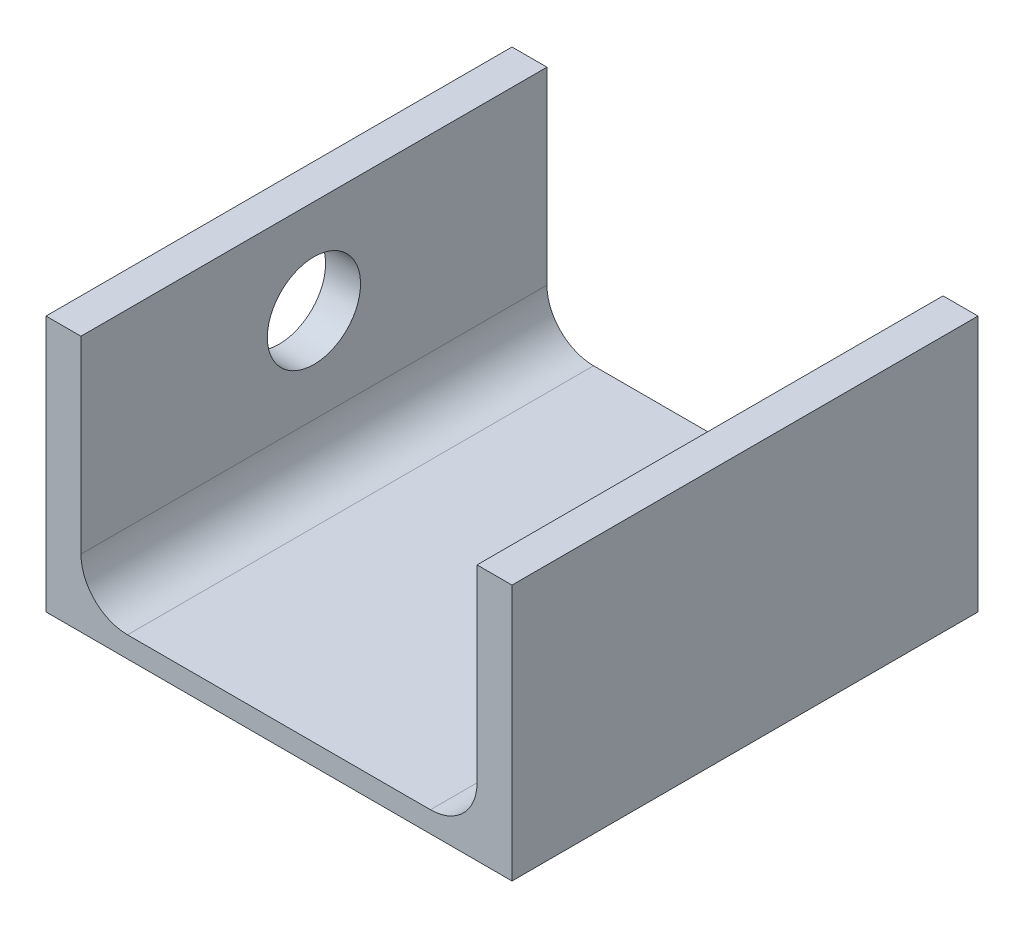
from build123d import *

# Parameters (mm, degrees)
EXTRUSION1_DEPTH        = 100
ESQUISSE2_R             = 10
ENL_V_MAT_EXTRU_1_DEPTH = 10


with BuildPart() as part:
    # Esquisse1 → Extrusion1 (new body)
    with BuildSketch(Plane.XY):
        with BuildLine():
            Line((0, 0), (100, 0))
            Line((100, 0), (100, 55))
            Line((100, 55), (92.5, 55))
            Line((92.5, 55), (92.5, 14.5))
            ThreePointArc((92.5, 14.5), (89.571067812, 7.428932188), (82.5, 4.5))
            Line((82.5, 4.5), (17.5, 4.5))
            ThreePointArc((17.5, 4.5), (10.428932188, 7.428932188), (7.5, 14.5))
            Line((7.5, 14.5), (7.5, 55))
            Line((7.5, 55), (0, 55))
            Line((0, 55), (0, 0))
        make_face()
    extrude(amount=EXTRUSION1_DEPTH)

    # Esquisse2 → Enl_v. mat.-Extru.1 (cut)
    with BuildSketch(Plane.ZY):
        with Locations((50, 34.75)):
            Circle(ESQUISSE2_R)
    extrude(amount=-ENL_V_MAT_EXTRU_1_DEPTH, mode=Mode.SUBTRACT)


solid = part.part
